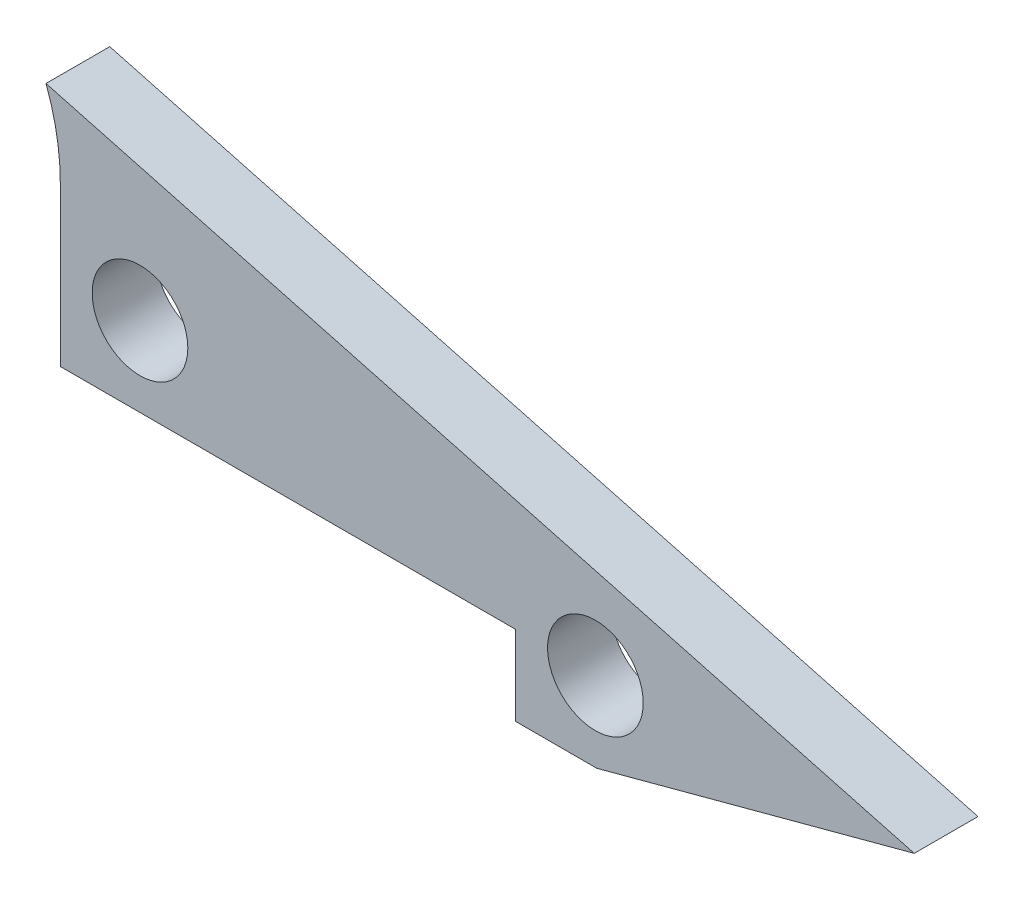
ISO-10303-21;
HEADER;
FILE_DESCRIPTION(('STEP AP214'),'2;1');
FILE_NAME('part.step','',(''),(''),'','','');
FILE_SCHEMA(('AUTOMOTIVE_DESIGN { 1 0 10303 214 1 1 1 1 }'));
ENDSEC;
DATA;
#1=APPLICATION_CONTEXT('core data for automotive mechanical design processes');
#2=APPLICATION_PROTOCOL_DEFINITION('international standard','automotive_design',2000,#1);
#3=PRODUCT_CONTEXT('',#1,'mechanical');
#4=PRODUCT('Part','Part','',(#3));
#5=PRODUCT_RELATED_PRODUCT_CATEGORY('part','',(#4));
#6=PRODUCT_DEFINITION_FORMATION('','',#4);
#7=PRODUCT_DEFINITION_CONTEXT('part definition',#1,'design');
#8=PRODUCT_DEFINITION('design','',#6,#7);
#9=PRODUCT_DEFINITION_SHAPE('','',#8);
#10=(LENGTH_UNIT() NAMED_UNIT(*) SI_UNIT(.MILLI.,.METRE.));
#11=(NAMED_UNIT(*) PLANE_ANGLE_UNIT() SI_UNIT($,.RADIAN.));
#12=(NAMED_UNIT(*) SI_UNIT($,.STERADIAN.) SOLID_ANGLE_UNIT());
#13=UNCERTAINTY_MEASURE_WITH_UNIT(LENGTH_MEASURE(1.E-05),#10,'distance_accuracy_value','');
#14=(GEOMETRIC_REPRESENTATION_CONTEXT(3) GLOBAL_UNCERTAINTY_ASSIGNED_CONTEXT((#13)) GLOBAL_UNIT_ASSIGNED_CONTEXT((#10,
#11,#12)) REPRESENTATION_CONTEXT('',''));
#15=CARTESIAN_POINT('',(0.,0.,0.));
#16=DIRECTION('',(0.,0.,1.));
#17=DIRECTION('',(1.,0.,0.));
#18=AXIS2_PLACEMENT_3D('',#15,#16,#17);
#19=CARTESIAN_POINT('',(-23.7828568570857,5.,1.));
#20=DIRECTION('',(0.,0.,1.));
#21=DIRECTION('',(1.,0.,0.));
#22=AXIS2_PLACEMENT_3D('',#19,#20,#21);
#23=PLANE('',#22);
#24=CARTESIAN_POINT('',(0.,0.,1.));
#25=DIRECTION('',(0.,0.,1.));
#26=DIRECTION('',(1.,0.,0.));
#27=AXIS2_PLACEMENT_3D('',#24,#25,#26);
#28=CIRCLE('',#27,1.5);
#29=CARTESIAN_POINT('',(1.5,0.,1.));
#30=VERTEX_POINT('',#29);
#31=EDGE_CURVE('E95',#30,#30,#28,.T.);
#32=ORIENTED_EDGE('',*,*,#31,.F.);
#33=EDGE_LOOP('',(#32));
#34=FACE_BOUND('',#33,.T.);
#35=CARTESIAN_POINT('',(-23.7828568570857,5.,1.));
#36=DIRECTION('',(0.,0.,-1.));
#37=DIRECTION('',(1.,0.,0.));
#38=AXIS2_PLACEMENT_3D('',#35,#36,#37);
#39=CIRCLE('',#38,7.);
#40=CARTESIAN_POINT('',(-17.2308583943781,7.46400408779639,1.));
#41=VERTEX_POINT('',#40);
#42=CARTESIAN_POINT('',(-16.7828568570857,5.,1.));
#43=VERTEX_POINT('',#42);
#44=EDGE_CURVE('E111',#41,#43,#39,.T.);
#45=ORIENTED_EDGE('',*,*,#44,.T.);
#46=DIRECTION('',(0.,-1.,0.));
#47=VECTOR('',#46,1.);
#48=CARTESIAN_POINT('',(-16.7828568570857,0.,1.));
#49=LINE('',#48,#47);
#50=CARTESIAN_POINT('',(-16.7828568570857,0.,1.));
#51=VERTEX_POINT('',#50);
#52=EDGE_CURVE('E90',#43,#51,#49,.T.);
#53=ORIENTED_EDGE('',*,*,#52,.T.);
#54=DIRECTION('',(1.,0.,0.));
#55=VECTOR('',#54,1.);
#56=CARTESIAN_POINT('',(-16.7828568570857,0.,1.));
#57=LINE('',#56,#55);
#58=CARTESIAN_POINT('',(-2.5,0.,1.));
#59=VERTEX_POINT('',#58);
#60=EDGE_CURVE('E114',#51,#59,#57,.T.);
#61=ORIENTED_EDGE('',*,*,#60,.T.);
#62=DIRECTION('',(0.,-1.,0.));
#63=VECTOR('',#62,1.);
#64=CARTESIAN_POINT('',(-2.5,0.,1.));
#65=LINE('',#64,#63);
#66=CARTESIAN_POINT('',(-2.5,-2.5,1.));
#67=VERTEX_POINT('',#66);
#68=EDGE_CURVE('E116',#59,#67,#65,.T.);
#69=ORIENTED_EDGE('',*,*,#68,.T.);
#70=DIRECTION('',(1.,0.,0.));
#71=VECTOR('',#70,1.);
#72=CARTESIAN_POINT('',(-2.5,-2.5,1.));
#73=LINE('',#72,#71);
#74=CARTESIAN_POINT('',(0.0446888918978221,-2.5,1.));
#75=VERTEX_POINT('',#74);
#76=EDGE_CURVE('E118',#67,#75,#73,.T.);
#77=ORIENTED_EDGE('',*,*,#76,.T.);
#78=DIRECTION('',(0.96592582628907,0.258819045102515,0.));
#79=VECTOR('',#78,1.);
#80=CARTESIAN_POINT('',(10.,0.167517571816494,1.));
#81=LINE('',#80,#79);
#82=CARTESIAN_POINT('',(10.,0.167517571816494,1.));
#83=VERTEX_POINT('',#82);
#84=EDGE_CURVE('E37',#75,#83,#81,.T.);
#85=ORIENTED_EDGE('',*,*,#84,.T.);
#86=DIRECTION('',(-0.965925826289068,0.258819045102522,0.));
#87=VECTOR('',#86,1.);
#88=CARTESIAN_POINT('',(-17.2308583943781,7.46400408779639,1.));
#89=LINE('',#88,#87);
#90=EDGE_CURVE('E32',#83,#41,#89,.T.);
#91=ORIENTED_EDGE('',*,*,#90,.T.);
#92=EDGE_LOOP('',(#45,#53,#61,#69,#77,#85,#91));
#93=FACE_BOUND('',#92,.T.);
#94=CARTESIAN_POINT('',(-14.2828568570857,2.5,1.));
#95=DIRECTION('',(0.,0.,1.));
#96=DIRECTION('',(1.,0.,0.));
#97=AXIS2_PLACEMENT_3D('',#94,#95,#96);
#98=CIRCLE('',#97,1.5);
#99=CARTESIAN_POINT('',(-12.7828568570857,2.5,1.));
#100=VERTEX_POINT('',#99);
#101=EDGE_CURVE('E182',#100,#100,#98,.T.);
#102=ORIENTED_EDGE('',*,*,#101,.F.);
#103=EDGE_LOOP('',(#102));
#104=FACE_BOUND('',#103,.T.);
#105=ADVANCED_FACE('F17',(#34,#93,#104),#23,.T.);
#106=CARTESIAN_POINT('',(-23.7828568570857,5.,-1.));
#107=DIRECTION('',(0.,0.,1.));
#108=DIRECTION('',(1.,0.,0.));
#109=AXIS2_PLACEMENT_3D('',#106,#107,#108);
#110=PLANE('',#109);
#111=CARTESIAN_POINT('',(0.,0.,-1.));
#112=DIRECTION('',(0.,0.,1.));
#113=DIRECTION('',(1.,0.,0.));
#114=AXIS2_PLACEMENT_3D('',#111,#112,#113);
#115=CIRCLE('',#114,1.5);
#116=CARTESIAN_POINT('',(1.5,0.,-1.));
#117=VERTEX_POINT('',#116);
#118=EDGE_CURVE('E98',#117,#117,#115,.T.);
#119=ORIENTED_EDGE('',*,*,#118,.T.);
#120=EDGE_LOOP('',(#119));
#121=FACE_BOUND('',#120,.T.);
#122=CARTESIAN_POINT('',(-23.7828568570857,5.,-1.));
#123=DIRECTION('',(0.,0.,-1.));
#124=DIRECTION('',(1.,0.,0.));
#125=AXIS2_PLACEMENT_3D('',#122,#123,#124);
#126=CIRCLE('',#125,7.);
#127=CARTESIAN_POINT('',(-17.2308583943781,7.46400408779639,-1.));
#128=VERTEX_POINT('',#127);
#129=CARTESIAN_POINT('',(-16.7828568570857,5.,-1.));
#130=VERTEX_POINT('',#129);
#131=EDGE_CURVE('E81',#128,#130,#126,.T.);
#132=ORIENTED_EDGE('',*,*,#131,.F.);
#133=DIRECTION('',(-0.965925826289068,0.258819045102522,0.));
#134=VECTOR('',#133,1.);
#135=CARTESIAN_POINT('',(-17.2308583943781,7.46400408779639,-1.));
#136=LINE('',#135,#134);
#137=CARTESIAN_POINT('',(10.,0.167517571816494,-1.));
#138=VERTEX_POINT('',#137);
#139=EDGE_CURVE('E109',#138,#128,#136,.T.);
#140=ORIENTED_EDGE('',*,*,#139,.F.);
#141=DIRECTION('',(0.96592582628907,0.258819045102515,0.));
#142=VECTOR('',#141,1.);
#143=CARTESIAN_POINT('',(10.,0.167517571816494,-1.));
#144=LINE('',#143,#142);
#145=CARTESIAN_POINT('',(0.0446888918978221,-2.5,-1.));
#146=VERTEX_POINT('',#145);
#147=EDGE_CURVE('E107',#146,#138,#144,.T.);
#148=ORIENTED_EDGE('',*,*,#147,.F.);
#149=DIRECTION('',(1.,0.,0.));
#150=VECTOR('',#149,1.);
#151=CARTESIAN_POINT('',(-2.5,-2.5,-1.));
#152=LINE('',#151,#150);
#153=CARTESIAN_POINT('',(-2.5,-2.5,-1.));
#154=VERTEX_POINT('',#153);
#155=EDGE_CURVE('E105',#154,#146,#152,.T.);
#156=ORIENTED_EDGE('',*,*,#155,.F.);
#157=DIRECTION('',(0.,-1.,0.));
#158=VECTOR('',#157,1.);
#159=CARTESIAN_POINT('',(-2.5,0.,-1.));
#160=LINE('',#159,#158);
#161=CARTESIAN_POINT('',(-2.5,0.,-1.));
#162=VERTEX_POINT('',#161);
#163=EDGE_CURVE('E103',#162,#154,#160,.T.);
#164=ORIENTED_EDGE('',*,*,#163,.F.);
#165=DIRECTION('',(1.,0.,0.));
#166=VECTOR('',#165,1.);
#167=CARTESIAN_POINT('',(-16.7828568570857,0.,-1.));
#168=LINE('',#167,#166);
#169=CARTESIAN_POINT('',(-16.7828568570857,0.,-1.));
#170=VERTEX_POINT('',#169);
#171=EDGE_CURVE('E83',#170,#162,#168,.T.);
#172=ORIENTED_EDGE('',*,*,#171,.F.);
#173=DIRECTION('',(0.,-1.,0.));
#174=VECTOR('',#173,1.);
#175=CARTESIAN_POINT('',(-16.7828568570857,0.,-1.));
#176=LINE('',#175,#174);
#177=EDGE_CURVE('E76',#130,#170,#176,.T.);
#178=ORIENTED_EDGE('',*,*,#177,.F.);
#179=EDGE_LOOP('',(#132,#140,#148,#156,#164,#172,#178));
#180=FACE_BOUND('',#179,.T.);
#181=CARTESIAN_POINT('',(-14.2828568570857,2.5,-1.));
#182=DIRECTION('',(0.,0.,1.));
#183=DIRECTION('',(1.,0.,0.));
#184=AXIS2_PLACEMENT_3D('',#181,#182,#183);
#185=CIRCLE('',#184,1.5);
#186=CARTESIAN_POINT('',(-12.7828568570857,2.5,-1.));
#187=VERTEX_POINT('',#186);
#188=EDGE_CURVE('E185',#187,#187,#185,.T.);
#189=ORIENTED_EDGE('',*,*,#188,.T.);
#190=EDGE_LOOP('',(#189));
#191=FACE_BOUND('',#190,.T.);
#192=ADVANCED_FACE('F77',(#121,#180,#191),#110,.F.);
#193=CARTESIAN_POINT('',(-23.7828568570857,5.,1.));
#194=DIRECTION('',(0.,0.,-1.));
#195=DIRECTION('',(-1.,0.,0.));
#196=AXIS2_PLACEMENT_3D('',#193,#194,#195);
#197=CYLINDRICAL_SURFACE('',#196,7.);
#198=ORIENTED_EDGE('',*,*,#131,.T.);
#199=DIRECTION('',(0.,0.,-1.));
#200=VECTOR('',#199,1.);
#201=CARTESIAN_POINT('',(-16.7828568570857,5.,1.));
#202=LINE('',#201,#200);
#203=EDGE_CURVE('E11',#43,#130,#202,.T.);
#204=ORIENTED_EDGE('',*,*,#203,.F.);
#205=ORIENTED_EDGE('',*,*,#44,.F.);
#206=DIRECTION('',(0.,0.,-1.));
#207=VECTOR('',#206,1.);
#208=CARTESIAN_POINT('',(-17.2308583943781,7.46400408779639,1.));
#209=LINE('',#208,#207);
#210=EDGE_CURVE('E94',#41,#128,#209,.T.);
#211=ORIENTED_EDGE('',*,*,#210,.T.);
#212=EDGE_LOOP('',(#198,#204,#205,#211));
#213=FACE_BOUND('',#212,.T.);
#214=ADVANCED_FACE('F19',(#213),#197,.F.);
#215=CARTESIAN_POINT('',(-16.7828568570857,0.,1.));
#216=DIRECTION('',(1.,0.,0.));
#217=DIRECTION('',(0.,1.,0.));
#218=AXIS2_PLACEMENT_3D('',#215,#216,#217);
#219=PLANE('',#218);
#220=ORIENTED_EDGE('',*,*,#177,.T.);
#221=DIRECTION('',(0.,0.,-1.));
#222=VECTOR('',#221,1.);
#223=CARTESIAN_POINT('',(-16.7828568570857,0.,1.));
#224=LINE('',#223,#222);
#225=EDGE_CURVE('E25',#51,#170,#224,.T.);
#226=ORIENTED_EDGE('',*,*,#225,.F.);
#227=ORIENTED_EDGE('',*,*,#52,.F.);
#228=ORIENTED_EDGE('',*,*,#203,.T.);
#229=EDGE_LOOP('',(#220,#226,#227,#228));
#230=FACE_BOUND('',#229,.T.);
#231=ADVANCED_FACE('F89',(#230),#219,.F.);
#232=CARTESIAN_POINT('',(-16.7828568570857,0.,1.));
#233=DIRECTION('',(0.,1.,0.));
#234=DIRECTION('',(0.,0.,1.));
#235=AXIS2_PLACEMENT_3D('',#232,#233,#234);
#236=PLANE('',#235);
#237=ORIENTED_EDGE('',*,*,#171,.T.);
#238=DIRECTION('',(0.,0.,-1.));
#239=VECTOR('',#238,1.);
#240=CARTESIAN_POINT('',(-2.5,0.,1.));
#241=LINE('',#240,#239);
#242=EDGE_CURVE('E132',#59,#162,#241,.T.);
#243=ORIENTED_EDGE('',*,*,#242,.F.);
#244=ORIENTED_EDGE('',*,*,#60,.F.);
#245=ORIENTED_EDGE('',*,*,#225,.T.);
#246=EDGE_LOOP('',(#237,#243,#244,#245));
#247=FACE_BOUND('',#246,.T.);
#248=ADVANCED_FACE('F136',(#247),#236,.F.);
#249=CARTESIAN_POINT('',(-2.5,0.,1.));
#250=DIRECTION('',(1.,0.,0.));
#251=DIRECTION('',(0.,1.,0.));
#252=AXIS2_PLACEMENT_3D('',#249,#250,#251);
#253=PLANE('',#252);
#254=ORIENTED_EDGE('',*,*,#163,.T.);
#255=DIRECTION('',(0.,0.,-1.));
#256=VECTOR('',#255,1.);
#257=CARTESIAN_POINT('',(-2.5,-2.5,1.));
#258=LINE('',#257,#256);
#259=EDGE_CURVE('E129',#67,#154,#258,.T.);
#260=ORIENTED_EDGE('',*,*,#259,.F.);
#261=ORIENTED_EDGE('',*,*,#68,.F.);
#262=ORIENTED_EDGE('',*,*,#242,.T.);
#263=EDGE_LOOP('',(#254,#260,#261,#262));
#264=FACE_BOUND('',#263,.T.);
#265=ADVANCED_FACE('F144',(#264),#253,.F.);
#266=CARTESIAN_POINT('',(-2.5,-2.5,1.));
#267=DIRECTION('',(0.,1.,0.));
#268=DIRECTION('',(-1.,0.,0.));
#269=AXIS2_PLACEMENT_3D('',#266,#267,#268);
#270=PLANE('',#269);
#271=ORIENTED_EDGE('',*,*,#155,.T.);
#272=DIRECTION('',(0.,0.,-1.));
#273=VECTOR('',#272,1.);
#274=CARTESIAN_POINT('',(0.0446888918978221,-2.5,1.));
#275=LINE('',#274,#273);
#276=EDGE_CURVE('E126',#75,#146,#275,.T.);
#277=ORIENTED_EDGE('',*,*,#276,.F.);
#278=ORIENTED_EDGE('',*,*,#76,.F.);
#279=ORIENTED_EDGE('',*,*,#259,.T.);
#280=EDGE_LOOP('',(#271,#277,#278,#279));
#281=FACE_BOUND('',#280,.T.);
#282=ADVANCED_FACE('F147',(#281),#270,.F.);
#283=CARTESIAN_POINT('',(10.,0.167517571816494,1.));
#284=DIRECTION('',(-0.258819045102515,0.96592582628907,0.));
#285=DIRECTION('',(-0.96592582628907,-0.258819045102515,0.));
#286=AXIS2_PLACEMENT_3D('',#283,#284,#285);
#287=PLANE('',#286);
#288=ORIENTED_EDGE('',*,*,#147,.T.);
#289=DIRECTION('',(0.,0.,-1.));
#290=VECTOR('',#289,1.);
#291=CARTESIAN_POINT('',(10.,0.167517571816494,1.));
#292=LINE('',#291,#290);
#293=EDGE_CURVE('E123',#83,#138,#292,.T.);
#294=ORIENTED_EDGE('',*,*,#293,.F.);
#295=ORIENTED_EDGE('',*,*,#84,.F.);
#296=ORIENTED_EDGE('',*,*,#276,.T.);
#297=EDGE_LOOP('',(#288,#294,#295,#296));
#298=FACE_BOUND('',#297,.T.);
#299=ADVANCED_FACE('F150',(#298),#287,.F.);
#300=CARTESIAN_POINT('',(-17.2308583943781,7.46400408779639,1.));
#301=DIRECTION('',(-0.258819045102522,-0.965925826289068,0.));
#302=DIRECTION('',(0.965925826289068,-0.258819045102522,0.));
#303=AXIS2_PLACEMENT_3D('',#300,#301,#302);
#304=PLANE('',#303);
#305=ORIENTED_EDGE('',*,*,#139,.T.);
#306=ORIENTED_EDGE('',*,*,#210,.F.);
#307=ORIENTED_EDGE('',*,*,#90,.F.);
#308=ORIENTED_EDGE('',*,*,#293,.T.);
#309=EDGE_LOOP('',(#305,#306,#307,#308));
#310=FACE_BOUND('',#309,.T.);
#311=ADVANCED_FACE('F152',(#310),#304,.F.);
#312=CARTESIAN_POINT('',(0.,0.,1.));
#313=DIRECTION('',(0.,0.,-1.));
#314=DIRECTION('',(-1.,0.,0.));
#315=AXIS2_PLACEMENT_3D('',#312,#313,#314);
#316=CYLINDRICAL_SURFACE('',#315,1.5);
#317=ORIENTED_EDGE('',*,*,#31,.T.);
#318=EDGE_LOOP('',(#317));
#319=FACE_BOUND('',#318,.T.);
#320=ORIENTED_EDGE('',*,*,#118,.F.);
#321=EDGE_LOOP('',(#320));
#322=FACE_BOUND('',#321,.T.);
#323=ADVANCED_FACE('F154',(#319,#322),#316,.F.);
#324=CARTESIAN_POINT('',(-14.2828568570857,2.5,1.));
#325=DIRECTION('',(0.,0.,-1.));
#326=DIRECTION('',(-1.,0.,0.));
#327=AXIS2_PLACEMENT_3D('',#324,#325,#326);
#328=CYLINDRICAL_SURFACE('',#327,1.5);
#329=ORIENTED_EDGE('',*,*,#101,.T.);
#330=EDGE_LOOP('',(#329));
#331=FACE_BOUND('',#330,.T.);
#332=ORIENTED_EDGE('',*,*,#188,.F.);
#333=EDGE_LOOP('',(#332));
#334=FACE_BOUND('',#333,.T.);
#335=ADVANCED_FACE('F161',(#331,#334),#328,.F.);
#336=CLOSED_SHELL('',(#105,#192,#214,#231,#248,#265,#282,#299,#311,#323,#335));
#337=MANIFOLD_SOLID_BREP('B1',#336);
#338=ADVANCED_BREP_SHAPE_REPRESENTATION('',(#18,#337),#14);
#339=SHAPE_DEFINITION_REPRESENTATION(#9,#338);
ENDSEC;
END-ISO-10303-21;
